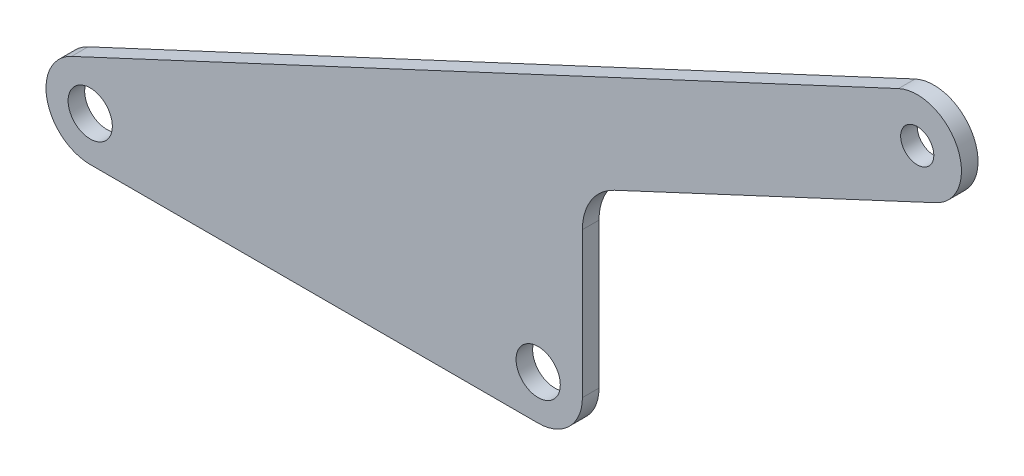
from build123d import *

# Parameters (mm, degrees)
ESQUISSE1_R             = 4
BOSS_EXTRU_1_DEPTH      = 3
ESQUISSE2_R             = 3
ENL_V_MAT_EXTRU_1_DEPTH = 176.699643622
ESQUISSE8_W             = 0.854807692
ESQUISSE8_H             = 4.7625
CUT_EXTRUDE_81_DEPTH    = 1


with BuildPart() as part:
    # Esquisse1 → Boss.-Extru.1 (new body)
    with BuildSketch(Plane.XY):
        with BuildLine():
            Line((-3.380946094, 7.250462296), (146.159838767, 76.982475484))
            ThreePointArc((146.159838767, 76.982475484), (156.791247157, 73.112959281), (152.921730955, 62.481550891))
            Line((152.921730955, 62.481550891), (94.773817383, 35.366733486))
            ThreePointArc((94.773817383, 35.366733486), (90.566085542, 31.676651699), (89, 26.303655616))
            Line((89, 26.303655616), (89, 0))
            ThreePointArc((89, 0), (86.656854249, -5.656854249), (81, -8))
            Line((81, -8), (0, -8))
            ThreePointArc((0, -8), (-7.810368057, -1.731516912), (-3.380946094, 7.250462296))
        make_face()
        Circle(ESQUISSE1_R, mode=Mode.SUBTRACT)
        with Locations((81, 0)):
            Circle(ESQUISSE1_R, mode=Mode.SUBTRACT)
    extrude(amount=BOSS_EXTRU_1_DEPTH)

    # Esquisse2 → Enl_v. mat.-Extru.1 (cut, through all)
    with BuildSketch(Plane.XY.offset(3)):
        with Locations((149.540784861, 69.732013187)):
            Circle(ESQUISSE2_R)
    extrude(amount=-ENL_V_MAT_EXTRU_1_DEPTH, mode=Mode.SUBTRACT)

    # Esquisse8 → Cut-Extrude 81 (cut)
    # profile 1 of 10: a face of its own
    with BuildSketch(Plane(origin=(0, 0, 0), x_dir=(-1, 0, 0), z_dir=(0, 0, -1))):
        Polygon((-18.459587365, -3.315306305), (-19.314395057, -3.315306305), (-19.314395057, 0.592386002), (-20.657664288, 0.592386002), (-20.657664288, 1.447193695), (-18.459587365, 1.447193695), align=None)
    # profile 2 of 10: a face of its own
    with BuildSketch(Plane(origin=(0, 0, 0), x_dir=(-1, 0, 0), z_dir=(0, 0, -1))):
        Polygon((-21.390356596, -3.315306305), (-23.954779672, -3.315306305), (-23.954779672, -2.460498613), (-22.245164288, -2.460498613), (-22.245164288, -1.544633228), (-23.954779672, -1.544633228), (-23.954779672, -0.689825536), (-22.245164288, -0.689825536), (-22.245164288, 0.592386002), (-23.954779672, 0.592386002), (-23.954779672, 1.447193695), (-21.390356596, 1.447193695), align=None)
    # profile 3 of 10: a face of its own
    with BuildSketch(Plane(origin=(0, 0, 0), x_dir=(-1, 0, 0), z_dir=(0, 0, -1))):
        Polygon((-24.412712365, -3.315306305), (-25.32571567, -3.315306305), (-26.549731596, 0.067671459), (-27.774701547, -3.315306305), (-28.686750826, -3.315306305), (-26.960916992, 1.447193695), (-26.136638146, 1.447193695), align=None)
    # profile 4 of 10: a face of its own
    with BuildSketch(Plane(origin=(0, 0, 0), x_dir=(-1, 0, 0), z_dir=(0, 0, -1))):
        with Locations((-29.755260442, -0.934056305)):
            Rectangle(ESQUISSE8_W, ESQUISSE8_H)
    # profile 5 of 10: a face of its own
    with BuildSketch(Plane(origin=(0, 0, 0), x_dir=(-1, 0, 0), z_dir=(0, 0, -1))):
        Polygon((-31.281702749, -3.315306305), (-33.846125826, -3.315306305), (-33.846125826, -2.460498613), (-32.136510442, -2.460498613), (-32.136510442, -1.544633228), (-33.846125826, -1.544633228), (-33.846125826, -0.689825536), (-32.136510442, -0.689825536), (-32.136510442, 0.592386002), (-33.846125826, 0.592386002), (-33.846125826, 1.447193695), (-31.281702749, 1.447193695), align=None)
    # profile 6 of 10: a face of its own
    with BuildSketch(Plane(origin=(0, 0, 0), x_dir=(-1, 0, 0), z_dir=(0, 0, -1))):
        with BuildLine():
            Line((-34.700933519, -3.315306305), (-35.696937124, -3.315306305))
            add(Edge.make_bspline(
                [(-35.696937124, -3.315306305), (-35.762773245, -3.315076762), (-35.889394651, -3.314635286), (-36.071966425, -3.307489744), (-36.239716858, -3.297806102), (-36.393018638, -3.282120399), (-36.53169705, -3.264096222), (-36.655469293, -3.239899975), (-36.764795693, -3.213058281), (-36.861021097, -3.18002818), (-36.947648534, -3.142050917), (-37.02808026, -3.099058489), (-37.104325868, -3.049880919), (-37.175830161, -2.994676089), (-37.244793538, -2.935540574), (-37.307523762, -2.869037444), (-37.366819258, -2.797343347), (-37.422057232, -2.720453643), (-37.471653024, -2.638547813), (-37.514419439, -2.552605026), (-37.551242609, -2.463146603), (-37.580384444, -2.369845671), (-37.603625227, -2.272967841), (-37.619166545, -2.172753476), (-37.630713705, -2.068978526), (-37.631368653, -1.998466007), (-37.631702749, -1.96249681)],
                knots=[0, 0, 0, 0, 1.748592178, 3.36303531, 4.852592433, 6.210838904, 7.455605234, 8.565530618, 9.559147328, 10.443333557, 11.264119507, 12.069061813, 12.863340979, 13.67089394, 14.467102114, 15.273638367, 16.095597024, 16.937114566, 17.786018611, 18.63597263, 19.484582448, 20.352808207, 21.22970172, 22.128176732, 23.04516274, 24, 24, 24, 24], degree=3))
            add(Edge.make_bspline(
                [(-37.631702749, -1.96249681), (-37.630823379, -1.924955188), (-37.629099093, -1.851342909), (-37.619888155, -1.743198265), (-37.602763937, -1.639482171), (-37.577672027, -1.540860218), (-37.547638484, -1.446322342), (-37.508742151, -1.357344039), (-37.464511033, -1.272351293), (-37.412038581, -1.192744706), (-37.354416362, -1.116813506), (-37.287494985, -1.047315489), (-37.215055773, -0.980956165), (-37.134894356, -0.919995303), (-37.04725073, -0.864812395), (-36.953772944, -0.813165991), (-36.853169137, -0.765973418), (-36.782502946, -0.73957696), (-36.746366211, -0.726078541)],
                knots=[0, 0, 0, 0, 1.099808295, 2.156523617, 3.176426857, 4.17500812, 5.135317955, 6.078349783, 7.015890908, 7.9382699, 8.868004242, 9.803692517, 10.759882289, 11.743580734, 12.748787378, 13.791075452, 14.870417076, 16, 16, 16, 16], degree=3))
            Line((-36.746366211, -0.726078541), (-37.845404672, 1.447193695))
            Line((-37.845404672, 1.447193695), (-36.895194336, 1.447193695))
            Line((-36.895194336, 1.447193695), (-35.845765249, -0.628767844))
            Line((-35.845765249, -0.628767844), (-35.555741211, -0.628767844))
            Line((-35.555741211, -0.628767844), (-35.555741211, 1.447193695))
            Line((-35.555741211, 1.447193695), (-34.700933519, 1.447193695))
            Line((-34.700933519, 1.447193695), (-34.700933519, -3.315306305))
        make_face()
        with BuildLine():
            Line((-35.555741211, -1.483575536), (-35.888696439, -1.483575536))
            add(Edge.make_bspline(
                [(-35.888696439, -1.483575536), (-35.92940299, -1.484033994), (-36.007347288, -1.484911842), (-36.119441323, -1.488983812), (-36.221249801, -1.498794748), (-36.313208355, -1.511191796), (-36.395784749, -1.52550192), (-36.46822638, -1.546022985), (-36.53170042, -1.567971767), (-36.585295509, -1.595379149), (-36.631272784, -1.625999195), (-36.669811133, -1.662319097), (-36.703762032, -1.702105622), (-36.730393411, -1.747862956), (-36.751909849, -1.797716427), (-36.765253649, -1.852603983), (-36.77584069, -1.911531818), (-36.77653418, -1.952582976), (-36.776895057, -1.973945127)],
                knots=[0, 0, 0, 0, 1.688935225, 3.233948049, 4.651771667, 5.929878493, 7.083962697, 8.124219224, 9.050753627, 9.864999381, 10.615157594, 11.334035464, 12.05533055, 12.777108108, 13.522027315, 14.29964284, 15.115170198, 16, 16, 16, 16], degree=3))
            add(Edge.make_bspline(
                [(-36.776895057, -1.973945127), (-36.775972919, -1.999199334), (-36.774172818, -2.048497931), (-36.754708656, -2.11966969), (-36.725339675, -2.186023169), (-36.683762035, -2.246639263), (-36.631892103, -2.299674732), (-36.572450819, -2.346145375), (-36.504298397, -2.383339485), (-36.441369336, -2.40870709), (-36.383173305, -2.423328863), (-36.331002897, -2.433787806), (-36.270475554, -2.442260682), (-36.201677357, -2.448496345), (-36.124734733, -2.4544297), (-36.039465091, -2.458103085), (-35.945944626, -2.459742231), (-35.880746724, -2.460239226), (-35.846719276, -2.460498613)],
                knots=[0, 0, 0, 0, 1.020050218, 1.991234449, 2.965145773, 3.94719294, 4.948794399, 5.958308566, 6.989992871, 8.082620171, 8.694688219, 9.416833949, 10.236190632, 11.167557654, 12.21328564, 13.36031274, 14.622320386, 16, 16, 16, 16], degree=3))
            Line((-35.846719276, -2.460498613), (-35.555741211, -2.460498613))
            Line((-35.555741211, -2.460498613), (-35.555741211, -1.483575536))
        make_face(mode=Mode.SUBTRACT)
    # profile 7 of 10: a face of its own
    with BuildSketch(Plane(origin=(0, 0, 0), x_dir=(-1, 0, 0), z_dir=(0, 0, -1))):
        with BuildLine():
            add(Edge.make_bspline(
                [(-42.596456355, -1.117229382), (-42.646405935, -1.08155309), (-42.745276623, -1.010935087), (-42.875518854, -0.884453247), (-42.988432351, -0.743817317), (-43.082391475, -0.58948424), (-43.157454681, -0.424302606), (-43.209039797, -0.250494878), (-43.243534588, -0.070750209), (-43.247171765, 0.051609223), (-43.249010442, 0.113464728)],
                knots=[0, 0, 0, 0, 1.013470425, 2.00607327, 2.989559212, 3.987547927, 4.985093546, 5.979490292, 6.978585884, 8, 8, 8, 8], degree=3))
            add(Edge.make_bspline(
                [(-43.249010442, 0.113464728), (-43.246752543, 0.180433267), (-43.242274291, 0.313256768), (-43.202582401, 0.508018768), (-43.13919066, 0.694951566), (-43.051740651, 0.871846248), (-42.942601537, 1.033829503), (-42.816135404, 1.178377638), (-42.670454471, 1.299112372), (-42.535912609, 1.382198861), (-42.419299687, 1.436102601), (-42.325952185, 1.472902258), (-42.225774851, 1.501909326), (-42.120438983, 1.526858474), (-42.00884549, 1.545563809), (-41.892092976, 1.560288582), (-41.769086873, 1.567429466), (-41.685367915, 1.568671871), (-41.642429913, 1.569309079)],
                knots=[0, 0, 0, 0, 1.313633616, 2.605423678, 3.884827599, 5.180399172, 6.467003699, 7.709825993, 8.937691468, 10.168030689, 10.802071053, 11.45831639, 12.135866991, 12.84764728, 13.582572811, 14.35620613, 15.156926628, 16, 16, 16, 16], degree=3))
            add(Edge.make_bspline(
                [(-41.642429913, 1.569309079), (-41.596629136, 1.568684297), (-41.50718925, 1.567464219), (-41.376613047, 1.560176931), (-41.253492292, 1.54648251), (-41.137269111, 1.529252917), (-41.029009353, 1.503667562), (-40.927274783, 1.47585244), (-40.833165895, 1.441298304), (-40.718129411, 1.388003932), (-40.584785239, 1.308300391), (-40.442472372, 1.189140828), (-40.315671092, 1.049427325), (-40.209472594, 0.888159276), (-40.120980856, 0.712192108), (-40.057826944, 0.522410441), (-40.019788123, 0.32137726), (-40.015258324, 0.183593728), (-40.012952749, 0.113464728)],
                knots=[0, 0, 0, 0, 0.887187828, 1.732502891, 2.531768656, 3.28622382, 4.00645991, 4.68503301, 5.328123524, 5.945476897, 7.13918604, 8.324554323, 9.528234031, 10.780485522, 12.053158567, 13.332907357, 14.642504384, 16, 16, 16, 16], degree=3))
            add(Edge.make_bspline(
                [(-40.012952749, 0.113464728), (-40.014525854, 0.052261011), (-40.017619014, -0.068082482), (-40.049790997, -0.243730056), (-40.098841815, -0.411725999), (-40.170529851, -0.570523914), (-40.260533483, -0.722045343), (-40.372640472, -0.863181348), (-40.503025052, -0.997386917), (-40.602248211, -1.076619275), (-40.653104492, -1.117229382)],
                knots=[0, 0, 0, 0, 1.017680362, 2.001042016, 2.962316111, 3.924347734, 4.892953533, 5.888308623, 6.917664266, 8, 8, 8, 8], degree=3))
            add(Edge.make_bspline(
                [(-40.653104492, -1.117229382), (-40.621574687, -1.153574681), (-40.559501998, -1.22512763), (-40.479387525, -1.340381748), (-40.411020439, -1.458978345), (-40.355853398, -1.581618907), (-40.311498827, -1.706889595), (-40.279593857, -1.835561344), (-40.261449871, -1.968019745), (-40.258615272, -2.057528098), (-40.257183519, -2.102738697)],
                knots=[0, 0, 0, 0, 1.06167017, 2.090108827, 3.093337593, 4.079993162, 5.054811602, 6.023746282, 7.001795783, 8, 8, 8, 8], degree=3))
            add(Edge.make_bspline(
                [(-40.257183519, -2.102738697), (-40.259066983, -2.163945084), (-40.262782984, -2.284702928), (-40.296302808, -2.461457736), (-40.350715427, -2.629996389), (-40.427477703, -2.78810242), (-40.521940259, -2.934284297), (-40.636298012, -3.063509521), (-40.76717922, -3.176429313), (-40.915353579, -3.270704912), (-41.078208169, -3.345202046), (-41.253954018, -3.398752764), (-41.441780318, -3.431997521), (-41.571373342, -3.435586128), (-41.637659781, -3.43742169)],
                knots=[0, 0, 0, 0, 1.022461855, 2.017277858, 2.995792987, 3.975491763, 4.947267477, 5.896545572, 6.850353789, 7.828175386, 8.82259352, 9.83498435, 10.892601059, 12, 12, 12, 12], degree=3))
            add(Edge.make_bspline(
                [(-41.637659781, -3.43742169), (-41.702991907, -3.435588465), (-41.830375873, -3.43201406), (-42.015190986, -3.398862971), (-42.187698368, -3.344177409), (-42.347660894, -3.268695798), (-42.493773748, -3.173324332), (-42.622331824, -3.056986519), (-42.736223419, -2.924376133), (-42.831765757, -2.774736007), (-42.908649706, -2.613510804), (-42.964813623, -2.444112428), (-42.997751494, -2.2684263), (-43.002427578, -2.149302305), (-43.004779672, -2.089382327)],
                knots=[0, 0, 0, 0, 1.094374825, 2.133801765, 3.135215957, 4.120034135, 5.089936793, 6.048819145, 7.016727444, 8.011879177, 9.015716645, 10.003559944, 10.995780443, 12, 12, 12, 12], degree=3))
            add(Edge.make_bspline(
                [(-43.004779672, -2.089382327), (-43.00363952, -2.047037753), (-43.001402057, -1.963939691), (-42.984919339, -1.841494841), (-42.957002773, -1.724078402), (-42.918608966, -1.608391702), (-42.863005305, -1.492899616), (-42.791925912, -1.372025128), (-42.701539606, -1.245529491), (-42.632587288, -1.161343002), (-42.596456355, -1.117229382)],
                knots=[0, 0, 0, 0, 0.940860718, 1.84636882, 2.739437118, 3.619946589, 4.54937856, 5.582024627, 6.73298378, 8, 8, 8, 8], degree=3))
        make_face()
        with BuildLine():
            add(Edge.make_bspline(
                [(-41.616671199, -2.582613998), (-41.581484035, -2.580885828), (-41.512731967, -2.577509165), (-41.415087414, -2.548085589), (-41.327142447, -2.499869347), (-41.251230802, -2.432915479), (-41.189554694, -2.350792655), (-41.143442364, -2.257186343), (-41.11635774, -2.152576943), (-41.113475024, -2.079365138), (-41.111991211, -2.041681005)],
                knots=[0, 0, 0, 0, 1.017635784, 1.98835473, 2.924394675, 3.903775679, 4.896969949, 5.881752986, 6.909679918, 8, 8, 8, 8], degree=3))
            add(Edge.make_bspline(
                [(-41.111991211, -2.041681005), (-41.113841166, -2.003681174), (-41.117453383, -1.929482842), (-41.145234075, -1.822638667), (-41.194331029, -1.726426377), (-41.26018704, -1.642182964), (-41.33816523, -1.571034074), (-41.428648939, -1.520493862), (-41.527682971, -1.488170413), (-41.597337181, -1.485128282), (-41.632889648, -1.483575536)],
                knots=[0, 0, 0, 0, 1.071109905, 2.091445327, 3.086230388, 4.096303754, 5.093673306, 6.041538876, 7.0003745, 8, 8, 8, 8], degree=3))
            add(Edge.make_bspline(
                [(-41.632889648, -1.483575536), (-41.669035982, -1.485222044), (-41.739455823, -1.488429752), (-41.839991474, -1.518982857), (-41.929619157, -1.570113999), (-42.007857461, -1.638701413), (-42.071216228, -1.7236504), (-42.1177345, -1.821400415), (-42.144527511, -1.931523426), (-42.148112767, -2.008461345), (-42.14997198, -2.04835919)],
                knots=[0, 0, 0, 0, 1.008985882, 1.965693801, 2.905634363, 3.876216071, 4.854591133, 5.849205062, 6.884658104, 8, 8, 8, 8], degree=3))
            add(Edge.make_bspline(
                [(-42.14997198, -2.04835919), (-42.148203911, -2.086064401), (-42.144780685, -2.159066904), (-42.116517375, -2.262991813), (-42.069770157, -2.355792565), (-42.005684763, -2.436319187), (-41.925934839, -2.501580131), (-41.833172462, -2.54951603), (-41.728281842, -2.577332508), (-41.654680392, -2.580815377), (-41.616671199, -2.582613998)],
                knots=[0, 0, 0, 0, 1.066147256, 2.064208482, 3.022454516, 3.989792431, 4.955788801, 5.918128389, 6.924881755, 8, 8, 8, 8], degree=3))
        make_face(mode=Mode.SUBTRACT)
        with BuildLine():
            add(Edge.make_bspline(
                [(-41.644337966, -0.628767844), (-41.617589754, -0.628333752), (-41.564869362, -0.627478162), (-41.487422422, -0.617239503), (-41.412797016, -0.60270423), (-41.342300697, -0.580058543), (-41.274065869, -0.553604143), (-41.209814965, -0.519058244), (-41.14844712, -0.478928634), (-41.091286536, -0.433201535), (-41.039610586, -0.383060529), (-40.993033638, -0.330752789), (-40.954962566, -0.274940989), (-40.923258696, -0.217476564), (-40.897784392, -0.157905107), (-40.880943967, -0.095245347), (-40.870101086, -0.030331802), (-40.868545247, 0.013884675), (-40.867760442, 0.036188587)],
                knots=[0, 0, 0, 0, 1.129662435, 2.226550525, 3.296682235, 4.33815786, 5.351414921, 6.385493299, 7.41431807, 8.4469981, 9.473537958, 10.454642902, 11.401552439, 12.321859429, 13.225429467, 14.131893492, 15.057679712, 16, 16, 16, 16], degree=3))
            add(Edge.make_bspline(
                [(-40.867760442, 0.036188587), (-40.868136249, 0.059448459), (-40.868881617, 0.105581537), (-40.880061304, 0.172932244), (-40.896287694, 0.237826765), (-40.918653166, 0.300081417), (-40.950336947, 0.358436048), (-40.986244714, 0.41516858), (-41.029626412, 0.468738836), (-41.078885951, 0.518803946), (-41.133221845, 0.564907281), (-41.192626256, 0.604759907), (-41.255851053, 0.6396979), (-41.323823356, 0.667195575), (-41.395846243, 0.688062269), (-41.471482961, 0.703172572), (-41.551209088, 0.713246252), (-41.605826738, 0.714075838), (-41.633843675, 0.714501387)],
                knots=[0, 0, 0, 0, 0.974019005, 1.931846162, 2.853358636, 3.777086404, 4.695411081, 5.630991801, 6.588726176, 7.578582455, 8.572023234, 9.570371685, 10.572628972, 11.595075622, 12.6370648, 13.711634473, 14.826148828, 16, 16, 16, 16], degree=3))
            add(Edge.make_bspline(
                [(-41.633843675, 0.714501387), (-41.662170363, 0.713987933), (-41.717370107, 0.712987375), (-41.798061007, 0.704144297), (-41.874380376, 0.690112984), (-41.946236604, 0.670044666), (-42.013903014, 0.644337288), (-42.076466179, 0.611613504), (-42.135375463, 0.574540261), (-42.188661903, 0.531183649), (-42.237209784, 0.484404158), (-42.278440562, 0.432492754), (-42.315513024, 0.378753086), (-42.343406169, 0.319717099), (-42.367295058, 0.258813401), (-42.381493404, 0.193724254), (-42.393294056, 0.125972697), (-42.393895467, 0.079178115), (-42.394202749, 0.055269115)],
                knots=[0, 0, 0, 0, 1.200730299, 2.339843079, 3.437336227, 4.487507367, 5.49914389, 6.500211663, 7.47645343, 8.445123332, 9.408146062, 10.328401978, 11.252108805, 12.168702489, 13.09034032, 14.019150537, 14.98791428, 16, 16, 16, 16], degree=3))
            add(Edge.make_bspline(
                [(-42.394202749, 0.055269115), (-42.393329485, 0.031394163), (-42.391622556, -0.015273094), (-42.38229565, -0.084194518), (-42.364757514, -0.149508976), (-42.341950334, -0.212845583), (-42.311172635, -0.272315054), (-42.274793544, -0.329738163), (-42.230332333, -0.382651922), (-42.181184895, -0.433444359), (-42.12594168, -0.478892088), (-42.066664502, -0.518752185), (-42.004928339, -0.553828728), (-41.938747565, -0.580020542), (-41.870187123, -0.602714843), (-41.797447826, -0.617238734), (-41.721906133, -0.627480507), (-41.67045121, -0.628334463), (-41.644337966, -0.628767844)],
                knots=[0, 0, 0, 0, 1.011607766, 1.977342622, 2.937803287, 3.871057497, 4.822789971, 5.768019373, 6.744124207, 7.744188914, 8.758214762, 9.766859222, 10.76764927, 11.758144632, 12.776187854, 13.822267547, 14.894806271, 16, 16, 16, 16], degree=3))
        make_face(mode=Mode.SUBTRACT)
    # profile 8 of 10: a face of its own
    with BuildSketch(Plane(origin=(0, 0, 0), x_dir=(-1, 0, 0), z_dir=(0, 0, -1))):
        Polygon((-44.553164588, -3.315306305), (-45.874491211, -3.315306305), (-45.874491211, 1.447193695), (-45.019683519, 1.447193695), (-45.019683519, -2.521556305), (-44.042760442, -2.521556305), align=None)
    # profile 9 of 10: a face of its own
    with BuildSketch(Plane(origin=(0, 0, 0), x_dir=(-1, 0, 0), z_dir=(0, 0, -1))):
        with BuildLine():
            Line((-47.584106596, -2.033094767), (-48.438914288, -2.033094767))
            Line((-48.438914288, -2.033094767), (-48.438914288, -1.617139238))
            add(Edge.make_bspline(
                [(-48.438914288, -1.617139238), (-48.476944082, -1.655500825), (-48.551821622, -1.731031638), (-48.675972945, -1.828517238), (-48.806068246, -1.911012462), (-48.942279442, -1.978318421), (-49.084741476, -2.030039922), (-49.233306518, -2.06745058), (-49.388770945, -2.089686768), (-49.494631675, -2.092647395), (-49.54844704, -2.094152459)],
                knots=[0, 0, 0, 0, 1.041604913, 2.050834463, 3.038316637, 4.009881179, 4.976705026, 5.957567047, 6.961708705, 8, 8, 8, 8], degree=3))
            add(Edge.make_bspline(
                [(-49.54844704, -2.094152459), (-49.602359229, -2.09258695), (-49.708544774, -2.089503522), (-49.862879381, -2.057112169), (-50.01009064, -2.008979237), (-50.147635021, -1.938958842), (-50.274068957, -1.849466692), (-50.389076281, -1.742636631), (-50.489949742, -1.616473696), (-50.544977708, -1.522177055), (-50.573071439, -1.474035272)],
                knots=[0, 0, 0, 0, 1.024152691, 2.017173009, 2.987074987, 3.963745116, 4.940565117, 5.925016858, 6.940647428, 8, 8, 8, 8], degree=3))
            add(Edge.make_bspline(
                [(-50.573071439, -1.474035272), (-50.609215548, -1.522296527), (-50.680436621, -1.617394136), (-50.804403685, -1.743242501), (-50.941379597, -1.850083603), (-51.089191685, -1.938526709), (-51.246149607, -2.009299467), (-51.411769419, -2.056808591), (-51.58337498, -2.089479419), (-51.700574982, -2.09258233), (-51.759880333, -2.094152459)],
                knots=[0, 0, 0, 0, 1.037128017, 2.043635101, 3.03033952, 4.019910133, 5.002657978, 5.984795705, 6.980269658, 8, 8, 8, 8], degree=3))
            add(Edge.make_bspline(
                [(-51.759880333, -2.094152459), (-51.82077188, -2.092310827), (-51.939966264, -2.088705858), (-52.112654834, -2.055408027), (-52.274099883, -2.001638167), (-52.42273653, -1.927690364), (-52.554763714, -1.835230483), (-52.669327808, -1.729616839), (-52.763116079, -1.609800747), (-52.824459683, -1.49814792), (-52.864348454, -1.399115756), (-52.887754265, -1.313021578), (-52.910768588, -1.216875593), (-52.926426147, -1.109499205), (-52.94161643, -0.991617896), (-52.950293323, -0.862927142), (-52.956230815, -0.723592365), (-52.956858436, -0.627185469), (-52.957183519, -0.577250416)],
                knots=[0, 0, 0, 0, 1.314938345, 2.573974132, 3.78459701, 4.983357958, 6.148344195, 7.257110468, 8.339160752, 9.421974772, 9.998865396, 10.64273999, 11.347995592, 12.134448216, 12.986103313, 13.916514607, 14.920834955, 16, 16, 16, 16], degree=3))
            Line((-52.957183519, -0.577250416), (-52.957183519, 1.447193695))
            Line((-52.957183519, 1.447193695), (-52.102375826, 1.447193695))
            Line((-52.102375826, 1.447193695), (-52.102375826, -0.300582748))
            add(Edge.make_bspline(
                [(-52.102375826, -0.300582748), (-52.101664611, -0.347332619), (-52.100299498, -0.437064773), (-52.094490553, -0.565766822), (-52.081505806, -0.682494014), (-52.066238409, -0.787868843), (-52.044552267, -0.881409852), (-52.01766156, -0.962973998), (-51.987901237, -1.033833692), (-51.95104275, -1.093025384), (-51.90903004, -1.142545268), (-51.862997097, -1.18507831), (-51.811656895, -1.220403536), (-51.756382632, -1.250598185), (-51.69503286, -1.272294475), (-51.629469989, -1.288068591), (-51.559284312, -1.299434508), (-51.510927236, -1.300073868), (-51.486074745, -1.300402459)],
                knots=[0, 0, 0, 0, 1.668224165, 3.202005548, 4.594066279, 5.856954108, 6.99908446, 8.014481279, 8.918830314, 9.734251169, 10.49113052, 11.229935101, 11.963318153, 12.709491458, 13.470441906, 14.276733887, 15.114349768, 16, 16, 16, 16], degree=3))
            add(Edge.make_bspline(
                [(-51.486074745, -1.300402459), (-51.447773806, -1.299103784), (-51.372615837, -1.296555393), (-51.263366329, -1.271397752), (-51.159936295, -1.232225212), (-51.063620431, -1.176834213), (-50.976953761, -1.106844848), (-50.900262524, -1.025157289), (-50.837272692, -0.929989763), (-50.793613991, -0.841775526), (-50.766344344, -0.761993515), (-50.747106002, -0.69366949), (-50.732111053, -0.616404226), (-50.72037422, -0.530981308), (-50.709114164, -0.436917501), (-50.703590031, -0.334331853), (-50.697937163, -0.223366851), (-50.698010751, -0.14667576), (-50.698048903, -0.10691538)],
                knots=[0, 0, 0, 0, 1.129739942, 2.216889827, 3.293272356, 4.387340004, 5.483220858, 6.573288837, 7.683171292, 8.842706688, 9.46955235, 10.171503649, 10.937877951, 11.792080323, 12.718438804, 13.735081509, 14.82575644, 16, 16, 16, 16], degree=3))
            Line((-50.698048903, -0.10691538), (-50.698048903, 1.447193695))
            Line((-50.698048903, 1.447193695), (-49.843241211, 1.447193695))
            Line((-49.843241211, 1.447193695), (-49.843241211, -0.221398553))
            add(Edge.make_bspline(
                [(-49.843241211, -0.221398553), (-49.843220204, -0.258613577), (-49.843179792, -0.33020323), (-49.838342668, -0.433828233), (-49.835130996, -0.529432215), (-49.825246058, -0.617051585), (-49.816852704, -0.696820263), (-49.804086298, -0.768683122), (-49.790040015, -0.832751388), (-49.769129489, -0.906321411), (-49.736159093, -0.987078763), (-49.685730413, -1.070961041), (-49.628518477, -1.143322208), (-49.560679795, -1.201338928), (-49.484123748, -1.245594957), (-49.400280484, -1.27701839), (-49.309251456, -1.296715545), (-49.246123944, -1.299148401), (-49.213583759, -1.300402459)],
                knots=[0, 0, 0, 0, 1.256123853, 2.41637541, 3.502009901, 4.48372579, 5.391893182, 6.209077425, 6.946175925, 7.605351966, 8.789593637, 9.877720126, 10.900490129, 11.89027361, 12.87169595, 13.870636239, 14.902382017, 16, 16, 16, 16], degree=3))
            add(Edge.make_bspline(
                [(-49.213583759, -1.300402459), (-49.17684732, -1.29916981), (-49.104090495, -1.296728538), (-48.998608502, -1.270104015), (-48.897350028, -1.231266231), (-48.803351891, -1.174487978), (-48.717121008, -1.103602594), (-48.641033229, -1.019517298), (-48.579035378, -0.921066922), (-48.535951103, -0.830323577), (-48.506825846, -0.749247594), (-48.489357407, -0.678447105), (-48.472733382, -0.599986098), (-48.461347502, -0.512828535), (-48.449951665, -0.417841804), (-48.444466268, -0.31429472), (-48.438800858, -0.20237834), (-48.438875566, -0.12505128), (-48.438914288, -0.084972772)],
                knots=[0, 0, 0, 0, 1.079037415, 2.137042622, 3.183431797, 4.262184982, 5.35281204, 6.459745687, 7.583996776, 8.764732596, 9.410119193, 10.116187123, 10.909221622, 11.769657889, 12.702031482, 13.724407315, 14.820563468, 16, 16, 16, 16], degree=3))
            Line((-48.438914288, -0.084972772), (-48.438914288, 1.447193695))
            Line((-48.438914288, 1.447193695), (-47.584106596, 1.447193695))
            Line((-47.584106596, 1.447193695), (-47.584106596, -2.033094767))
        make_face()
    # profile 10 of 10: a face of its own
    with BuildSketch(Plane(origin=(0, 0, 0), x_dir=(-1, 0, 0), z_dir=(0, 0, -1))):
        with BuildLine():
            Line((-53.811991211, -2.033094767), (-54.666798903, -2.033094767))
            Line((-54.666798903, -2.033094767), (-54.666798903, -1.617139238))
            add(Edge.make_bspline(
                [(-54.666798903, -1.617139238), (-54.704828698, -1.655500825), (-54.779706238, -1.731031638), (-54.90385756, -1.828517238), (-55.033952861, -1.911012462), (-55.170164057, -1.978318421), (-55.312626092, -2.030039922), (-55.461191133, -2.06745058), (-55.61665556, -2.089686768), (-55.722516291, -2.092647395), (-55.776331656, -2.094152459)],
                knots=[0, 0, 0, 0, 1.041604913, 2.050834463, 3.038316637, 4.009881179, 4.976705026, 5.957567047, 6.961708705, 8, 8, 8, 8], degree=3))
            add(Edge.make_bspline(
                [(-55.776331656, -2.094152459), (-55.830243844, -2.09258695), (-55.93642939, -2.089503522), (-56.090763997, -2.057112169), (-56.237975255, -2.008979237), (-56.375519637, -1.938958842), (-56.501953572, -1.849466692), (-56.616960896, -1.742636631), (-56.717834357, -1.616473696), (-56.772862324, -1.522177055), (-56.800956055, -1.474035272)],
                knots=[0, 0, 0, 0, 1.024152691, 2.017173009, 2.987074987, 3.963745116, 4.940565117, 5.925016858, 6.940647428, 8, 8, 8, 8], degree=3))
            add(Edge.make_bspline(
                [(-56.800956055, -1.474035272), (-56.837100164, -1.522296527), (-56.908321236, -1.617394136), (-57.032288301, -1.743242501), (-57.169264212, -1.850083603), (-57.317076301, -1.938526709), (-57.474034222, -2.009299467), (-57.639654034, -2.056808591), (-57.811259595, -2.089479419), (-57.928459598, -2.09258233), (-57.987764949, -2.094152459)],
                knots=[0, 0, 0, 0, 1.037128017, 2.043635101, 3.03033952, 4.019910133, 5.002657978, 5.984795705, 6.980269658, 8, 8, 8, 8], degree=3))
            add(Edge.make_bspline(
                [(-57.987764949, -2.094152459), (-58.048656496, -2.092310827), (-58.16785088, -2.088705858), (-58.340539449, -2.055408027), (-58.501984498, -2.001638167), (-58.650621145, -1.927690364), (-58.782648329, -1.835230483), (-58.897212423, -1.729616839), (-58.991000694, -1.609800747), (-59.052344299, -1.49814792), (-59.092233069, -1.399115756), (-59.11563888, -1.313021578), (-59.138653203, -1.216875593), (-59.154310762, -1.109499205), (-59.169501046, -0.991617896), (-59.178177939, -0.862927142), (-59.184115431, -0.723592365), (-59.184743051, -0.627185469), (-59.185068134, -0.577250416)],
                knots=[0, 0, 0, 0, 1.314938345, 2.573974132, 3.78459701, 4.983357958, 6.148344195, 7.257110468, 8.339160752, 9.421974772, 9.998865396, 10.64273999, 11.347995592, 12.134448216, 12.986103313, 13.916514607, 14.920834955, 16, 16, 16, 16], degree=3))
            Line((-59.185068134, -0.577250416), (-59.185068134, 1.447193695))
            Line((-59.185068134, 1.447193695), (-58.330260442, 1.447193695))
            Line((-58.330260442, 1.447193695), (-58.330260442, -0.300582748))
            add(Edge.make_bspline(
                [(-58.330260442, -0.300582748), (-58.329549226, -0.347332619), (-58.328184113, -0.437064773), (-58.322375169, -0.565766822), (-58.309390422, -0.682494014), (-58.294123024, -0.787868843), (-58.272436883, -0.881409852), (-58.245546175, -0.962973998), (-58.215785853, -1.033833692), (-58.178927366, -1.093025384), (-58.136914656, -1.142545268), (-58.090881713, -1.18507831), (-58.039541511, -1.220403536), (-57.984267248, -1.250598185), (-57.922917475, -1.272294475), (-57.857354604, -1.288068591), (-57.787168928, -1.299434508), (-57.738811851, -1.300073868), (-57.71395936, -1.300402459)],
                knots=[0, 0, 0, 0, 1.668224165, 3.202005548, 4.594066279, 5.856954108, 6.99908446, 8.014481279, 8.918830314, 9.734251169, 10.49113052, 11.229935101, 11.963318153, 12.709491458, 13.470441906, 14.276733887, 15.114349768, 16, 16, 16, 16], degree=3))
            add(Edge.make_bspline(
                [(-57.71395936, -1.300402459), (-57.675658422, -1.299103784), (-57.600500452, -1.296555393), (-57.491250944, -1.271397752), (-57.387820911, -1.232225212), (-57.291505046, -1.176834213), (-57.204838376, -1.106844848), (-57.12814714, -1.025157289), (-57.065157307, -0.929989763), (-57.021498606, -0.841775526), (-56.994228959, -0.761993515), (-56.974990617, -0.69366949), (-56.959995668, -0.616404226), (-56.948258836, -0.530981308), (-56.936998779, -0.436917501), (-56.931474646, -0.334331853), (-56.925821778, -0.223366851), (-56.925895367, -0.14667576), (-56.925933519, -0.10691538)],
                knots=[0, 0, 0, 0, 1.129739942, 2.216889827, 3.293272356, 4.387340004, 5.483220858, 6.573288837, 7.683171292, 8.842706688, 9.46955235, 10.171503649, 10.937877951, 11.792080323, 12.718438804, 13.735081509, 14.82575644, 16, 16, 16, 16], degree=3))
            Line((-56.925933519, -0.10691538), (-56.925933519, 1.447193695))
            Line((-56.925933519, 1.447193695), (-56.071125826, 1.447193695))
            Line((-56.071125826, 1.447193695), (-56.071125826, -0.221398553))
            add(Edge.make_bspline(
                [(-56.071125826, -0.221398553), (-56.071104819, -0.258613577), (-56.071064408, -0.33020323), (-56.066227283, -0.433828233), (-56.063015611, -0.529432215), (-56.053130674, -0.617051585), (-56.04473732, -0.696820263), (-56.031970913, -0.768683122), (-56.017924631, -0.832751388), (-55.997014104, -0.906321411), (-55.964043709, -0.987078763), (-55.913615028, -1.070961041), (-55.856403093, -1.143322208), (-55.78856441, -1.201338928), (-55.712008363, -1.245594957), (-55.6281651, -1.27701839), (-55.537136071, -1.296715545), (-55.47400856, -1.299148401), (-55.441468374, -1.300402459)],
                knots=[0, 0, 0, 0, 1.256123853, 2.41637541, 3.502009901, 4.48372579, 5.391893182, 6.209077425, 6.946175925, 7.605351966, 8.789593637, 9.877720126, 10.900490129, 11.89027361, 12.87169595, 13.870636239, 14.902382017, 16, 16, 16, 16], degree=3))
            add(Edge.make_bspline(
                [(-55.441468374, -1.300402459), (-55.404731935, -1.29916981), (-55.33197511, -1.296728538), (-55.226493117, -1.270104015), (-55.125234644, -1.231266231), (-55.031236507, -1.174487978), (-54.945005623, -1.103602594), (-54.868917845, -1.019517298), (-54.806919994, -0.921066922), (-54.763835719, -0.830323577), (-54.734710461, -0.749247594), (-54.717242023, -0.678447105), (-54.700617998, -0.599986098), (-54.689232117, -0.512828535), (-54.67783628, -0.417841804), (-54.672350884, -0.31429472), (-54.666685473, -0.20237834), (-54.666760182, -0.12505128), (-54.666798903, -0.084972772)],
                knots=[0, 0, 0, 0, 1.079037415, 2.137042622, 3.183431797, 4.262184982, 5.35281204, 6.459745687, 7.583996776, 8.764732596, 9.410119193, 10.116187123, 10.909221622, 11.769657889, 12.702031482, 13.724407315, 14.820563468, 16, 16, 16, 16], degree=3))
            Line((-54.666798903, -0.084972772), (-54.666798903, 1.447193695))
            Line((-54.666798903, 1.447193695), (-53.811991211, 1.447193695))
            Line((-53.811991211, 1.447193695), (-53.811991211, -2.033094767))
        make_face()
    extrude(amount=-CUT_EXTRUDE_81_DEPTH, mode=Mode.SUBTRACT)


solid = part.part
